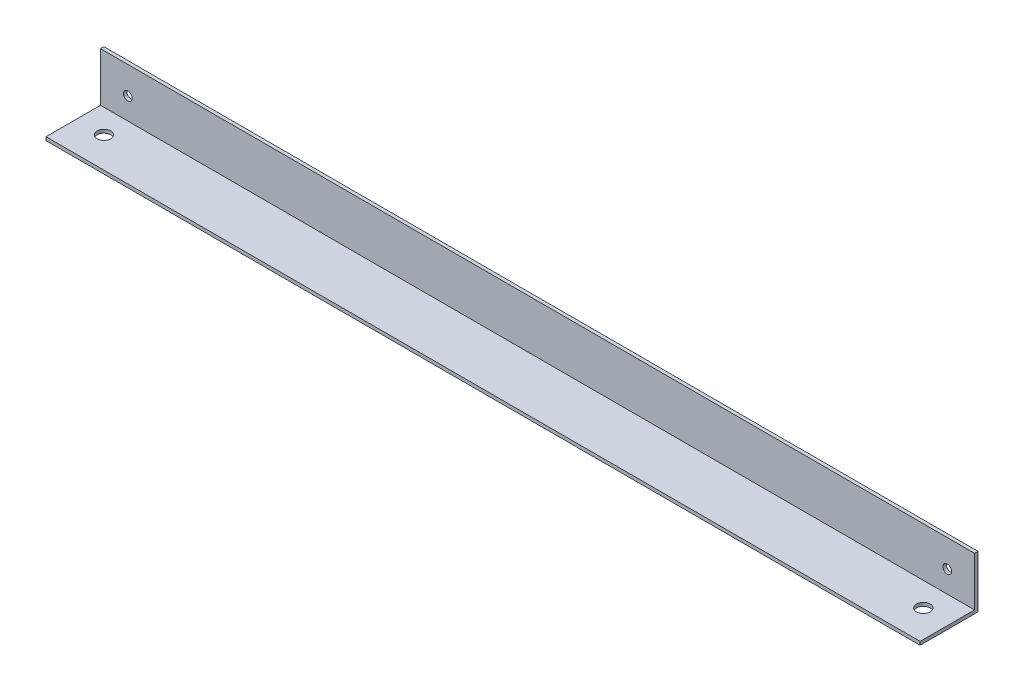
from build123d import *

# Parameters (mm, degrees)
SKETCH1_W           = 406.4
SKETCH1_H           = 24.384
BOSS_EXTRUDE1_DEPTH = 26.924
SKETCH2_W           = 406.4
SKETCH2_H           = 25.3365
CUT_EXTRUDE1_DEPTH  = 12.7
SKETCH3_W           = 406.4
SKETCH3_H           = 10.0965
CUT_EXTRUDE3_DEPTH  = 25.3365
SKETCH4_R           = 3.175
CUT_EXTRUDE4_DEPTH  = 2.54
SKETCH5_R           = 2.032
CUT_EXTRUDE5_DEPTH  = 2.54


with BuildPart() as part:
    # Sketch1 → Boss-Extrude1 (new body)
    with BuildSketch(Plane.XY):
        with Locations((-6.626086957, 55.646509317)):
            Rectangle(SKETCH1_W, SKETCH1_H)
    extrude(amount=BOSS_EXTRUDE1_DEPTH)

    # Sketch2 → Cut-Extrude1 (cut)
    with BuildSketch(Plane(origin=(0, 67.838509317, 0), x_dir=(1, 0, 0), z_dir=(0, 1, 0))):
        with Locations((-6.626086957, -14.25575)):
            Rectangle(SKETCH2_W, SKETCH2_H)
    extrude(amount=-CUT_EXTRUDE1_DEPTH, mode=Mode.SUBTRACT)

    # Sketch3 → Cut-Extrude3 (cut)
    with BuildSketch(Plane.XY.offset(26.924)):
        with Locations((-6.626086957, 50.090259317)):
            Rectangle(SKETCH3_W, SKETCH3_H)
    extrude(amount=-CUT_EXTRUDE3_DEPTH, mode=Mode.SUBTRACT)

    # Sketch4 → Cut-Extrude4 (cut)
    with BuildSketch(Plane.XZ.offset(-43.454509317)):
        with Locations(Location((-197.126086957, 12.7, 0), (0, 0, 270))):
            Circle(SKETCH4_R)
        with Locations(Location((183.873913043, 12.7, 0), (0, 0, 270))):
            Circle(SKETCH4_R)
    extrude(amount=-CUT_EXTRUDE4_DEPTH, mode=Mode.SUBTRACT)

    # Sketch5 → Cut-Extrude5 (cut)
    with BuildSketch(Plane(origin=(0, 0, 0), x_dir=(-1, 0, 0), z_dir=(0, 0, -1))):
        with Locations((-183.873913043, 55.138509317)):
            Circle(SKETCH5_R)
        with Locations((197.126086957, 55.138509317)):
            Circle(SKETCH5_R)
    extrude(amount=-CUT_EXTRUDE5_DEPTH, mode=Mode.SUBTRACT)


solid = part.part
